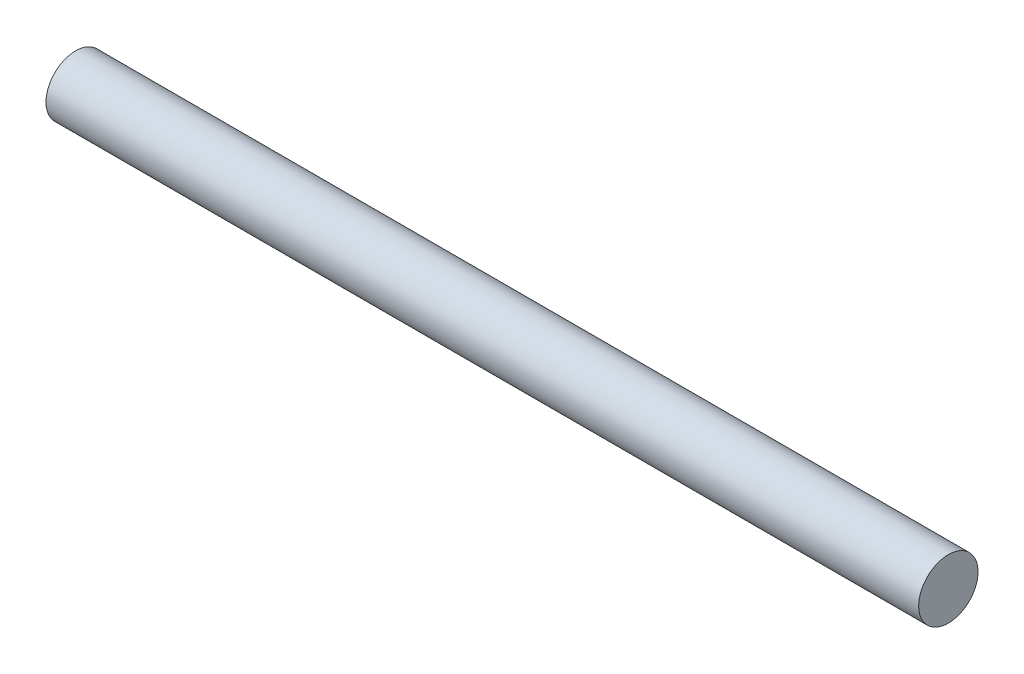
from build123d import *

# Parameters (mm, degrees)
SKETCH1_W = 145.542
SKETCH1_H = 4.953


with BuildPart() as part:
    # Sketch1 → Revolve1 (revolve)
    with BuildSketch(Plane.XY, mode=Mode.PRIVATE) as revolve1_sk:
        with Locations((72.771, 2.4765)):
            Rectangle(SKETCH1_W, SKETCH1_H)
    revolve(revolve1_sk.sketch.rotate(Axis((145.542, 0, 0), (-1, 0, 0)), 270), axis=Axis((145.542, 0, 0), (-1, 0, 0)))


solid = part.part
